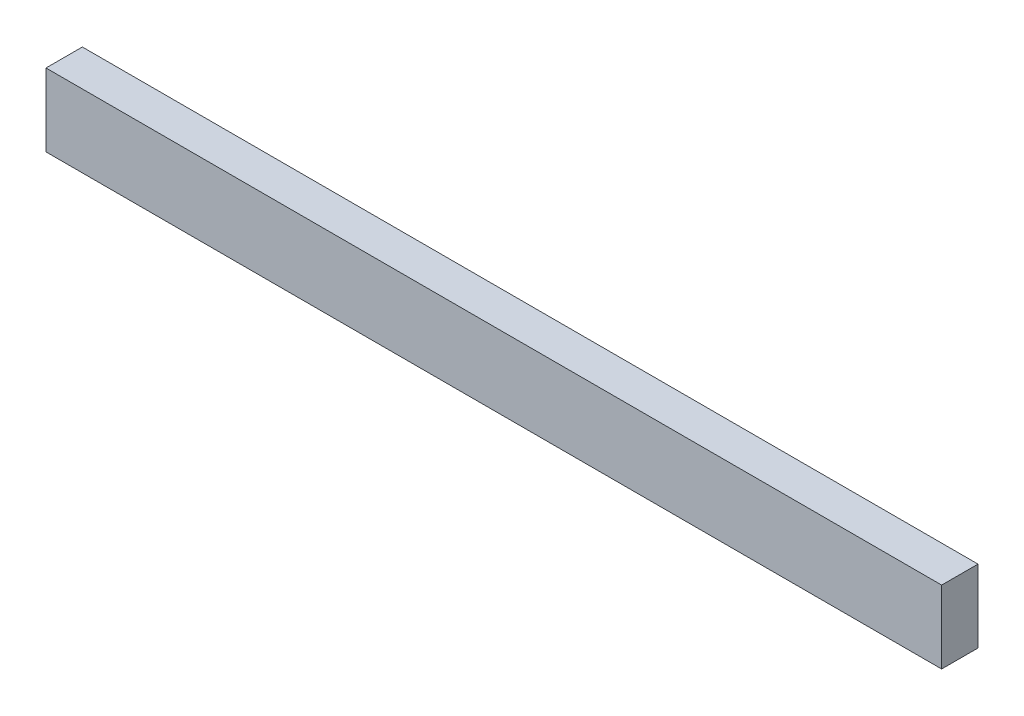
ISO-10303-21;
HEADER;
FILE_DESCRIPTION(('STEP AP214'),'2;1');
FILE_NAME('part.step','',(''),(''),'','','');
FILE_SCHEMA(('AUTOMOTIVE_DESIGN { 1 0 10303 214 1 1 1 1 }'));
ENDSEC;
DATA;
#1=APPLICATION_CONTEXT('core data for automotive mechanical design processes');
#2=APPLICATION_PROTOCOL_DEFINITION('international standard','automotive_design',2000,#1);
#3=PRODUCT_CONTEXT('',#1,'mechanical');
#4=PRODUCT('Part','Part','',(#3));
#5=PRODUCT_RELATED_PRODUCT_CATEGORY('part','',(#4));
#6=PRODUCT_DEFINITION_FORMATION('','',#4);
#7=PRODUCT_DEFINITION_CONTEXT('part definition',#1,'design');
#8=PRODUCT_DEFINITION('design','',#6,#7);
#9=PRODUCT_DEFINITION_SHAPE('','',#8);
#10=(LENGTH_UNIT() NAMED_UNIT(*) SI_UNIT(.MILLI.,.METRE.));
#11=(NAMED_UNIT(*) PLANE_ANGLE_UNIT() SI_UNIT($,.RADIAN.));
#12=(NAMED_UNIT(*) SI_UNIT($,.STERADIAN.) SOLID_ANGLE_UNIT());
#13=UNCERTAINTY_MEASURE_WITH_UNIT(LENGTH_MEASURE(1.E-05),#10,'distance_accuracy_value','');
#14=(GEOMETRIC_REPRESENTATION_CONTEXT(3) GLOBAL_UNCERTAINTY_ASSIGNED_CONTEXT((#13)) GLOBAL_UNIT_ASSIGNED_CONTEXT((#10,
#11,#12)) REPRESENTATION_CONTEXT('',''));
#15=CARTESIAN_POINT('',(0.,0.,0.));
#16=DIRECTION('',(0.,0.,1.));
#17=DIRECTION('',(1.,0.,0.));
#18=AXIS2_PLACEMENT_3D('',#15,#16,#17);
#19=CARTESIAN_POINT('',(-13.1248792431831,-3.66862222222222,1.));
#20=DIRECTION('',(1.,0.,0.));
#21=DIRECTION('',(0.,0.,-1.));
#22=AXIS2_PLACEMENT_3D('',#19,#20,#21);
#23=PLANE('',#22);
#24=DIRECTION('',(0.,-1.,0.));
#25=VECTOR('',#24,1.);
#26=CARTESIAN_POINT('',(-13.1248792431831,-3.66862222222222,0.));
#27=LINE('',#26,#25);
#28=CARTESIAN_POINT('',(-13.1248792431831,-1.66862222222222,0.));
#29=VERTEX_POINT('',#28);
#30=CARTESIAN_POINT('',(-13.1248792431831,-3.66862222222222,0.));
#31=VERTEX_POINT('',#30);
#32=EDGE_CURVE('E96',#29,#31,#27,.T.);
#33=ORIENTED_EDGE('',*,*,#32,.T.);
#34=DIRECTION('',(0.,0.,-1.));
#35=VECTOR('',#34,1.);
#36=CARTESIAN_POINT('',(-13.1248792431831,-3.66862222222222,1.));
#37=LINE('',#36,#35);
#38=CARTESIAN_POINT('',(-13.1248792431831,-3.66862222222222,1.));
#39=VERTEX_POINT('',#38);
#40=EDGE_CURVE('E11',#39,#31,#37,.T.);
#41=ORIENTED_EDGE('',*,*,#40,.F.);
#42=DIRECTION('',(0.,-1.,0.));
#43=VECTOR('',#42,1.);
#44=CARTESIAN_POINT('',(-13.1248792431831,-3.66862222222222,1.));
#45=LINE('',#44,#43);
#46=CARTESIAN_POINT('',(-13.1248792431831,-1.66862222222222,1.));
#47=VERTEX_POINT('',#46);
#48=EDGE_CURVE('E84',#47,#39,#45,.T.);
#49=ORIENTED_EDGE('',*,*,#48,.F.);
#50=DIRECTION('',(0.,0.,-1.));
#51=VECTOR('',#50,1.);
#52=CARTESIAN_POINT('',(-13.1248792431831,-1.66862222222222,1.));
#53=LINE('',#52,#51);
#54=EDGE_CURVE('E92',#47,#29,#53,.T.);
#55=ORIENTED_EDGE('',*,*,#54,.T.);
#56=EDGE_LOOP('',(#33,#41,#49,#55));
#57=FACE_BOUND('',#56,.T.);
#58=ADVANCED_FACE('F33',(#57),#23,.F.);
#59=CARTESIAN_POINT('',(-13.1248792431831,-3.66862222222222,1.));
#60=DIRECTION('',(0.,1.,0.));
#61=DIRECTION('',(0.,0.,1.));
#62=AXIS2_PLACEMENT_3D('',#59,#60,#61);
#63=PLANE('',#62);
#64=DIRECTION('',(1.,0.,0.));
#65=VECTOR('',#64,1.);
#66=CARTESIAN_POINT('',(-13.1248792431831,-3.66862222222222,0.));
#67=LINE('',#66,#65);
#68=CARTESIAN_POINT('',(11.5151207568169,-3.66862222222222,0.));
#69=VERTEX_POINT('',#68);
#70=EDGE_CURVE('E88',#31,#69,#67,.T.);
#71=ORIENTED_EDGE('',*,*,#70,.T.);
#72=DIRECTION('',(0.,0.,-1.));
#73=VECTOR('',#72,1.);
#74=CARTESIAN_POINT('',(11.5151207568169,-3.66862222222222,1.));
#75=LINE('',#74,#73);
#76=CARTESIAN_POINT('',(11.5151207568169,-3.66862222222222,1.));
#77=VERTEX_POINT('',#76);
#78=EDGE_CURVE('E41',#77,#69,#75,.T.);
#79=ORIENTED_EDGE('',*,*,#78,.F.);
#80=DIRECTION('',(1.,0.,0.));
#81=VECTOR('',#80,1.);
#82=CARTESIAN_POINT('',(-13.1248792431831,-3.66862222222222,1.));
#83=LINE('',#82,#81);
#84=EDGE_CURVE('E79',#39,#77,#83,.T.);
#85=ORIENTED_EDGE('',*,*,#84,.F.);
#86=ORIENTED_EDGE('',*,*,#40,.T.);
#87=EDGE_LOOP('',(#71,#79,#85,#86));
#88=FACE_BOUND('',#87,.T.);
#89=ADVANCED_FACE('F87',(#88),#63,.F.);
#90=CARTESIAN_POINT('',(11.5151207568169,-3.66862222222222,1.));
#91=DIRECTION('',(-1.,0.,0.));
#92=DIRECTION('',(0.,0.,1.));
#93=AXIS2_PLACEMENT_3D('',#90,#91,#92);
#94=PLANE('',#93);
#95=DIRECTION('',(0.,1.,0.));
#96=VECTOR('',#95,1.);
#97=CARTESIAN_POINT('',(11.5151207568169,-3.66862222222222,0.));
#98=LINE('',#97,#96);
#99=CARTESIAN_POINT('',(11.5151207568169,-1.66862222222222,0.));
#100=VERTEX_POINT('',#99);
#101=EDGE_CURVE('E66',#69,#100,#98,.T.);
#102=ORIENTED_EDGE('',*,*,#101,.T.);
#103=DIRECTION('',(0.,0.,-1.));
#104=VECTOR('',#103,1.);
#105=CARTESIAN_POINT('',(11.5151207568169,-1.66862222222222,1.));
#106=LINE('',#105,#104);
#107=CARTESIAN_POINT('',(11.5151207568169,-1.66862222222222,1.));
#108=VERTEX_POINT('',#107);
#109=EDGE_CURVE('E89',#108,#100,#106,.T.);
#110=ORIENTED_EDGE('',*,*,#109,.F.);
#111=DIRECTION('',(0.,1.,0.));
#112=VECTOR('',#111,1.);
#113=CARTESIAN_POINT('',(11.5151207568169,-3.66862222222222,1.));
#114=LINE('',#113,#112);
#115=EDGE_CURVE('E82',#77,#108,#114,.T.);
#116=ORIENTED_EDGE('',*,*,#115,.F.);
#117=ORIENTED_EDGE('',*,*,#78,.T.);
#118=EDGE_LOOP('',(#102,#110,#116,#117));
#119=FACE_BOUND('',#118,.T.);
#120=ADVANCED_FACE('F90',(#119),#94,.F.);
#121=CARTESIAN_POINT('',(-13.1248792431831,-1.66862222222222,1.));
#122=DIRECTION('',(0.,-1.,0.));
#123=DIRECTION('',(0.,0.,-1.));
#124=AXIS2_PLACEMENT_3D('',#121,#122,#123);
#125=PLANE('',#124);
#126=DIRECTION('',(-1.,0.,0.));
#127=VECTOR('',#126,1.);
#128=CARTESIAN_POINT('',(-13.1248792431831,-1.66862222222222,0.));
#129=LINE('',#128,#127);
#130=EDGE_CURVE('E72',#100,#29,#129,.T.);
#131=ORIENTED_EDGE('',*,*,#130,.T.);
#132=ORIENTED_EDGE('',*,*,#54,.F.);
#133=DIRECTION('',(-1.,0.,0.));
#134=VECTOR('',#133,1.);
#135=CARTESIAN_POINT('',(-13.1248792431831,-1.66862222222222,1.));
#136=LINE('',#135,#134);
#137=EDGE_CURVE('E49',#108,#47,#136,.T.);
#138=ORIENTED_EDGE('',*,*,#137,.F.);
#139=ORIENTED_EDGE('',*,*,#109,.T.);
#140=EDGE_LOOP('',(#131,#132,#138,#139));
#141=FACE_BOUND('',#140,.T.);
#142=ADVANCED_FACE('F103',(#141),#125,.F.);
#143=CARTESIAN_POINT('',(0.,0.,1.));
#144=DIRECTION('',(0.,0.,-1.));
#145=DIRECTION('',(-1.,0.,0.));
#146=AXIS2_PLACEMENT_3D('',#143,#144,#145);
#147=PLANE('',#146);
#148=ORIENTED_EDGE('',*,*,#48,.T.);
#149=ORIENTED_EDGE('',*,*,#84,.T.);
#150=ORIENTED_EDGE('',*,*,#115,.T.);
#151=ORIENTED_EDGE('',*,*,#137,.T.);
#152=EDGE_LOOP('',(#148,#149,#150,#151));
#153=FACE_BOUND('',#152,.T.);
#154=ADVANCED_FACE('F80',(#153),#147,.F.);
#155=CARTESIAN_POINT('',(0.,0.,0.));
#156=DIRECTION('',(0.,0.,-1.));
#157=DIRECTION('',(-1.,0.,0.));
#158=AXIS2_PLACEMENT_3D('',#155,#156,#157);
#159=PLANE('',#158);
#160=ORIENTED_EDGE('',*,*,#32,.F.);
#161=ORIENTED_EDGE('',*,*,#130,.F.);
#162=ORIENTED_EDGE('',*,*,#101,.F.);
#163=ORIENTED_EDGE('',*,*,#70,.F.);
#164=EDGE_LOOP('',(#160,#161,#162,#163));
#165=FACE_BOUND('',#164,.T.);
#166=ADVANCED_FACE('F106',(#165),#159,.T.);
#167=CLOSED_SHELL('',(#58,#89,#120,#142,#154,#166));
#168=MANIFOLD_SOLID_BREP('B2',#167);
#169=ADVANCED_BREP_SHAPE_REPRESENTATION('',(#18,#168),#14);
#170=SHAPE_DEFINITION_REPRESENTATION(#9,#169);
ENDSEC;
END-ISO-10303-21;
